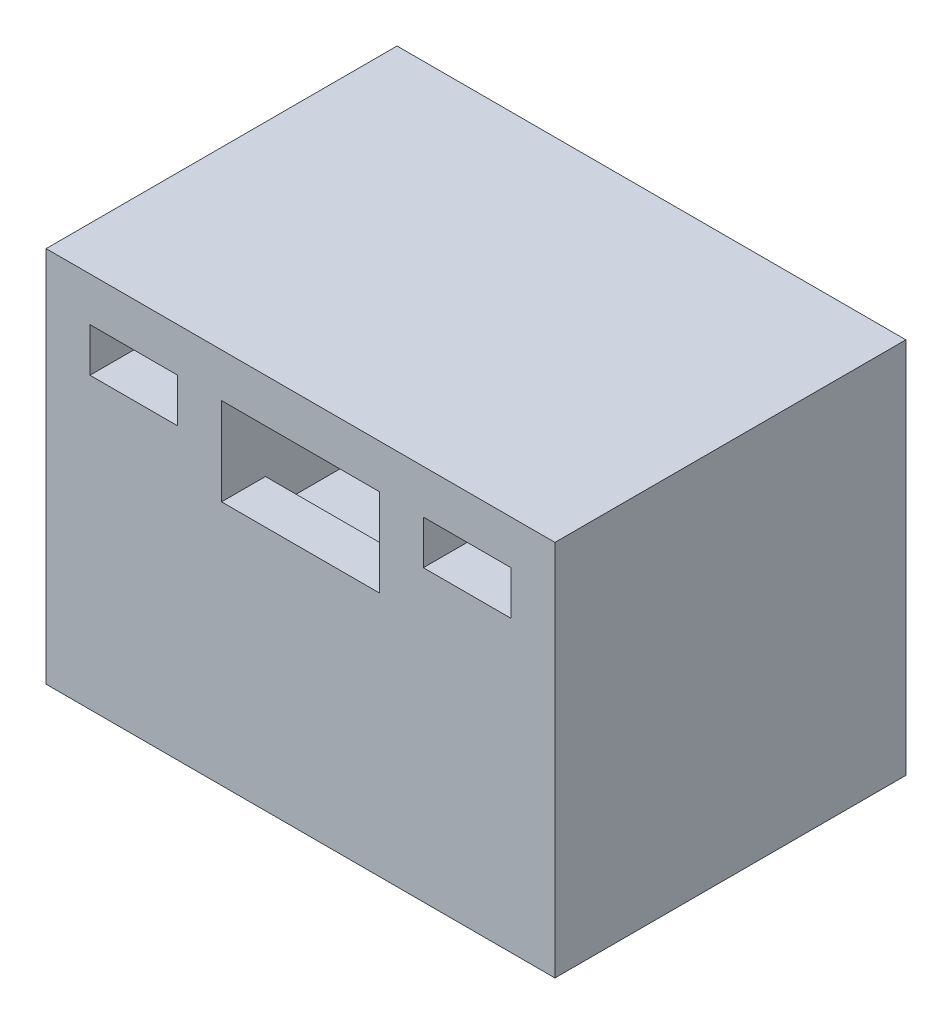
ISO-10303-21;
HEADER;
FILE_DESCRIPTION(('STEP AP214'),'2;1');
FILE_NAME('part.step','',(''),(''),'','','');
FILE_SCHEMA(('AUTOMOTIVE_DESIGN { 1 0 10303 214 1 1 1 1 }'));
ENDSEC;
DATA;
#1=APPLICATION_CONTEXT('core data for automotive mechanical design processes');
#2=APPLICATION_PROTOCOL_DEFINITION('international standard','automotive_design',2000,#1);
#3=PRODUCT_CONTEXT('',#1,'mechanical');
#4=PRODUCT('Part','Part','',(#3));
#5=PRODUCT_RELATED_PRODUCT_CATEGORY('part','',(#4));
#6=PRODUCT_DEFINITION_FORMATION('','',#4);
#7=PRODUCT_DEFINITION_CONTEXT('part definition',#1,'design');
#8=PRODUCT_DEFINITION('design','',#6,#7);
#9=PRODUCT_DEFINITION_SHAPE('','',#8);
#10=(LENGTH_UNIT() NAMED_UNIT(*) SI_UNIT(.MILLI.,.METRE.));
#11=(NAMED_UNIT(*) PLANE_ANGLE_UNIT() SI_UNIT($,.RADIAN.));
#12=(NAMED_UNIT(*) SI_UNIT($,.STERADIAN.) SOLID_ANGLE_UNIT());
#13=UNCERTAINTY_MEASURE_WITH_UNIT(LENGTH_MEASURE(1.E-05),#10,'distance_accuracy_value','');
#14=(GEOMETRIC_REPRESENTATION_CONTEXT(3) GLOBAL_UNCERTAINTY_ASSIGNED_CONTEXT((#13)) GLOBAL_UNIT_ASSIGNED_CONTEXT((#10,
#11,#12)) REPRESENTATION_CONTEXT('',''));
#15=CARTESIAN_POINT('',(0.,0.,0.));
#16=DIRECTION('',(0.,0.,1.));
#17=DIRECTION('',(1.,0.,0.));
#18=AXIS2_PLACEMENT_3D('',#15,#16,#17);
#19=CARTESIAN_POINT('',(0.900000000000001,0.300582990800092,4.));
#20=DIRECTION('',(0.,1.,0.));
#21=DIRECTION('',(-1.,0.,0.));
#22=AXIS2_PLACEMENT_3D('',#19,#20,#21);
#23=PLANE('',#22);
#24=DIRECTION('',(0.,0.,-1.));
#25=VECTOR('',#24,1.);
#26=CARTESIAN_POINT('',(-0.9,0.300582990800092,4.));
#27=LINE('',#26,#25);
#28=CARTESIAN_POINT('',(-0.9,0.300582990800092,3.5));
#29=VERTEX_POINT('',#28);
#30=CARTESIAN_POINT('',(-0.9,0.300582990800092,0.));
#31=VERTEX_POINT('',#30);
#32=EDGE_CURVE('E262',#29,#31,#27,.T.);
#33=ORIENTED_EDGE('',*,*,#32,.F.);
#34=DIRECTION('',(1.,0.,0.));
#35=VECTOR('',#34,1.);
#36=CARTESIAN_POINT('',(0.900000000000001,0.300582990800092,3.5));
#37=LINE('',#36,#35);
#38=CARTESIAN_POINT('',(0.900000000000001,0.300582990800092,3.5));
#39=VERTEX_POINT('',#38);
#40=EDGE_CURVE('E471',#29,#39,#37,.T.);
#41=ORIENTED_EDGE('',*,*,#40,.T.);
#42=DIRECTION('',(0.,0.,-1.));
#43=VECTOR('',#42,1.);
#44=CARTESIAN_POINT('',(0.900000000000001,0.300582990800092,4.));
#45=LINE('',#44,#43);
#46=CARTESIAN_POINT('',(0.900000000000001,0.300582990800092,0.));
#47=VERTEX_POINT('',#46);
#48=EDGE_CURVE('E260',#39,#47,#45,.T.);
#49=ORIENTED_EDGE('',*,*,#48,.T.);
#50=DIRECTION('',(1.,0.,0.));
#51=VECTOR('',#50,1.);
#52=CARTESIAN_POINT('',(0.900000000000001,0.300582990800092,0.));
#53=LINE('',#52,#51);
#54=EDGE_CURVE('E248',#31,#47,#53,.T.);
#55=ORIENTED_EDGE('',*,*,#54,.F.);
#56=EDGE_LOOP('',(#33,#41,#49,#55));
#57=FACE_BOUND('',#56,.T.);
#58=ADVANCED_FACE('F34',(#57),#23,.T.);
#59=CARTESIAN_POINT('',(-1.4,-0.199417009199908,4.));
#60=DIRECTION('',(-1.,0.,0.));
#61=DIRECTION('',(0.,0.,1.));
#62=AXIS2_PLACEMENT_3D('',#59,#60,#61);
#63=PLANE('',#62);
#64=DIRECTION('',(0.,0.,-1.));
#65=VECTOR('',#64,1.);
#66=CARTESIAN_POINT('',(-1.4,-0.199417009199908,4.));
#67=LINE('',#66,#65);
#68=CARTESIAN_POINT('',(-1.4,-0.199417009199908,3.5));
#69=VERTEX_POINT('',#68);
#70=CARTESIAN_POINT('',(-1.4,-0.199417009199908,0.));
#71=VERTEX_POINT('',#70);
#72=EDGE_CURVE('E517',#69,#71,#67,.T.);
#73=ORIENTED_EDGE('',*,*,#72,.F.);
#74=DIRECTION('',(0.,1.,0.));
#75=VECTOR('',#74,1.);
#76=CARTESIAN_POINT('',(-1.4,-0.199417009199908,3.5));
#77=LINE('',#76,#75);
#78=CARTESIAN_POINT('',(-1.4,0.649999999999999,3.5));
#79=VERTEX_POINT('',#78);
#80=EDGE_CURVE('E488',#69,#79,#77,.T.);
#81=ORIENTED_EDGE('',*,*,#80,.T.);
#82=DIRECTION('',(0.,0.,-1.));
#83=VECTOR('',#82,1.);
#84=CARTESIAN_POINT('',(-1.4,0.65,4.));
#85=LINE('',#84,#83);
#86=CARTESIAN_POINT('',(-1.4,0.65,0.));
#87=VERTEX_POINT('',#86);
#88=EDGE_CURVE('E231',#79,#87,#85,.T.);
#89=ORIENTED_EDGE('',*,*,#88,.T.);
#90=DIRECTION('',(0.,1.,0.));
#91=VECTOR('',#90,1.);
#92=CARTESIAN_POINT('',(-1.4,-0.199417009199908,0.));
#93=LINE('',#92,#91);
#94=EDGE_CURVE('E496',#71,#87,#93,.T.);
#95=ORIENTED_EDGE('',*,*,#94,.F.);
#96=EDGE_LOOP('',(#73,#81,#89,#95));
#97=FACE_BOUND('',#96,.T.);
#98=ADVANCED_FACE('F413',(#97),#63,.T.);
#99=CARTESIAN_POINT('',(-1.4,0.65,4.));
#100=DIRECTION('',(0.,-1.,0.));
#101=DIRECTION('',(1.,0.,0.));
#102=AXIS2_PLACEMENT_3D('',#99,#100,#101);
#103=PLANE('',#102);
#104=ORIENTED_EDGE('',*,*,#88,.F.);
#105=DIRECTION('',(-1.,0.,0.));
#106=VECTOR('',#105,1.);
#107=CARTESIAN_POINT('',(-2.4,0.649999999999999,3.5));
#108=LINE('',#107,#106);
#109=CARTESIAN_POINT('',(-2.4,0.649999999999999,3.5));
#110=VERTEX_POINT('',#109);
#111=EDGE_CURVE('E479',#79,#110,#108,.T.);
#112=ORIENTED_EDGE('',*,*,#111,.T.);
#113=DIRECTION('',(0.,0.,-1.));
#114=VECTOR('',#113,1.);
#115=CARTESIAN_POINT('',(-2.4,0.649999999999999,4.));
#116=LINE('',#115,#114);
#117=CARTESIAN_POINT('',(-2.4,0.649999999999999,0.));
#118=VERTEX_POINT('',#117);
#119=EDGE_CURVE('E222',#110,#118,#116,.T.);
#120=ORIENTED_EDGE('',*,*,#119,.T.);
#121=DIRECTION('',(-1.,0.,0.));
#122=VECTOR('',#121,1.);
#123=CARTESIAN_POINT('',(-1.4,0.65,0.));
#124=LINE('',#123,#122);
#125=EDGE_CURVE('E499',#87,#118,#124,.T.);
#126=ORIENTED_EDGE('',*,*,#125,.F.);
#127=EDGE_LOOP('',(#104,#112,#120,#126));
#128=FACE_BOUND('',#127,.T.);
#129=ADVANCED_FACE('F419',(#128),#103,.T.);
#130=CARTESIAN_POINT('',(-2.4,0.649999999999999,4.));
#131=DIRECTION('',(1.,0.,0.));
#132=DIRECTION('',(0.,1.,0.));
#133=AXIS2_PLACEMENT_3D('',#130,#131,#132);
#134=PLANE('',#133);
#135=ORIENTED_EDGE('',*,*,#119,.F.);
#136=DIRECTION('',(0.,-1.,0.));
#137=VECTOR('',#136,1.);
#138=CARTESIAN_POINT('',(-2.4,0.649999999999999,3.5));
#139=LINE('',#138,#137);
#140=CARTESIAN_POINT('',(-2.4,-1.65,3.5));
#141=VERTEX_POINT('',#140);
#142=EDGE_CURVE('E208',#110,#141,#139,.T.);
#143=ORIENTED_EDGE('',*,*,#142,.T.);
#144=DIRECTION('',(0.,0.,-1.));
#145=VECTOR('',#144,1.);
#146=CARTESIAN_POINT('',(-2.4,-1.65,4.));
#147=LINE('',#146,#145);
#148=CARTESIAN_POINT('',(-2.4,-1.65,0.));
#149=VERTEX_POINT('',#148);
#150=EDGE_CURVE('E220',#141,#149,#147,.T.);
#151=ORIENTED_EDGE('',*,*,#150,.T.);
#152=DIRECTION('',(0.,-1.,0.));
#153=VECTOR('',#152,1.);
#154=CARTESIAN_POINT('',(-2.4,0.649999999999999,0.));
#155=LINE('',#154,#153);
#156=EDGE_CURVE('E502',#118,#149,#155,.T.);
#157=ORIENTED_EDGE('',*,*,#156,.F.);
#158=EDGE_LOOP('',(#135,#143,#151,#157));
#159=FACE_BOUND('',#158,.T.);
#160=ADVANCED_FACE('F218',(#159),#134,.T.);
#161=CARTESIAN_POINT('',(-2.4,-1.65,4.));
#162=DIRECTION('',(0.,1.,0.));
#163=DIRECTION('',(-1.,0.,0.));
#164=AXIS2_PLACEMENT_3D('',#161,#162,#163);
#165=PLANE('',#164);
#166=ORIENTED_EDGE('',*,*,#150,.F.);
#167=DIRECTION('',(1.,0.,0.));
#168=VECTOR('',#167,1.);
#169=CARTESIAN_POINT('',(-2.4,-1.65,3.5));
#170=LINE('',#169,#168);
#171=CARTESIAN_POINT('',(2.4,-1.65,3.5));
#172=VERTEX_POINT('',#171);
#173=EDGE_CURVE('E205',#141,#172,#170,.T.);
#174=ORIENTED_EDGE('',*,*,#173,.T.);
#175=DIRECTION('',(0.,0.,-1.));
#176=VECTOR('',#175,1.);
#177=CARTESIAN_POINT('',(2.4,-1.65,4.));
#178=LINE('',#177,#176);
#179=CARTESIAN_POINT('',(2.4,-1.65,0.));
#180=VERTEX_POINT('',#179);
#181=EDGE_CURVE('E229',#172,#180,#178,.T.);
#182=ORIENTED_EDGE('',*,*,#181,.T.);
#183=DIRECTION('',(1.,0.,0.));
#184=VECTOR('',#183,1.);
#185=CARTESIAN_POINT('',(-2.4,-1.65,0.));
#186=LINE('',#185,#184);
#187=EDGE_CURVE('E227',#149,#180,#186,.T.);
#188=ORIENTED_EDGE('',*,*,#187,.F.);
#189=EDGE_LOOP('',(#166,#174,#182,#188));
#190=FACE_BOUND('',#189,.T.);
#191=ADVANCED_FACE('F225',(#190),#165,.T.);
#192=CARTESIAN_POINT('',(2.4,0.65,4.));
#193=DIRECTION('',(-1.,0.,0.));
#194=DIRECTION('',(0.,-1.,0.));
#195=AXIS2_PLACEMENT_3D('',#192,#193,#194);
#196=PLANE('',#195);
#197=ORIENTED_EDGE('',*,*,#181,.F.);
#198=DIRECTION('',(0.,1.,0.));
#199=VECTOR('',#198,1.);
#200=CARTESIAN_POINT('',(2.4,0.649999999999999,3.5));
#201=LINE('',#200,#199);
#202=CARTESIAN_POINT('',(2.4,0.649999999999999,3.5));
#203=VERTEX_POINT('',#202);
#204=EDGE_CURVE('E211',#172,#203,#201,.T.);
#205=ORIENTED_EDGE('',*,*,#204,.T.);
#206=DIRECTION('',(0.,0.,-1.));
#207=VECTOR('',#206,1.);
#208=CARTESIAN_POINT('',(2.4,0.65,4.));
#209=LINE('',#208,#207);
#210=CARTESIAN_POINT('',(2.4,0.65,0.));
#211=VERTEX_POINT('',#210);
#212=EDGE_CURVE('E233',#203,#211,#209,.T.);
#213=ORIENTED_EDGE('',*,*,#212,.T.);
#214=DIRECTION('',(0.,1.,0.));
#215=VECTOR('',#214,1.);
#216=CARTESIAN_POINT('',(2.4,0.65,0.));
#217=LINE('',#216,#215);
#218=EDGE_CURVE('E505',#180,#211,#217,.T.);
#219=ORIENTED_EDGE('',*,*,#218,.F.);
#220=EDGE_LOOP('',(#197,#205,#213,#219));
#221=FACE_BOUND('',#220,.T.);
#222=ADVANCED_FACE('F438',(#221),#196,.T.);
#223=CARTESIAN_POINT('',(1.4,0.65,4.));
#224=DIRECTION('',(0.,-1.,0.));
#225=DIRECTION('',(1.,0.,0.));
#226=AXIS2_PLACEMENT_3D('',#223,#224,#225);
#227=PLANE('',#226);
#228=ORIENTED_EDGE('',*,*,#212,.F.);
#229=CARTESIAN_POINT('',(1.4,0.649999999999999,3.5));
#230=VERTEX_POINT('',#229);
#231=EDGE_CURVE('E478',#203,#230,#108,.T.);
#232=ORIENTED_EDGE('',*,*,#231,.T.);
#233=DIRECTION('',(0.,0.,-1.));
#234=VECTOR('',#233,1.);
#235=CARTESIAN_POINT('',(1.4,0.65,4.));
#236=LINE('',#235,#234);
#237=CARTESIAN_POINT('',(1.4,0.65,0.));
#238=VERTEX_POINT('',#237);
#239=EDGE_CURVE('E521',#230,#238,#236,.T.);
#240=ORIENTED_EDGE('',*,*,#239,.T.);
#241=DIRECTION('',(-1.,0.,0.));
#242=VECTOR('',#241,1.);
#243=CARTESIAN_POINT('',(1.4,0.65,0.));
#244=LINE('',#243,#242);
#245=EDGE_CURVE('E508',#211,#238,#244,.T.);
#246=ORIENTED_EDGE('',*,*,#245,.F.);
#247=EDGE_LOOP('',(#228,#232,#240,#246));
#248=FACE_BOUND('',#247,.T.);
#249=ADVANCED_FACE('F441',(#248),#227,.T.);
#250=CARTESIAN_POINT('',(1.4,-0.199417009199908,4.));
#251=DIRECTION('',(1.,0.,0.));
#252=DIRECTION('',(0.,1.,0.));
#253=AXIS2_PLACEMENT_3D('',#250,#251,#252);
#254=PLANE('',#253);
#255=ORIENTED_EDGE('',*,*,#239,.F.);
#256=DIRECTION('',(0.,-1.,0.));
#257=VECTOR('',#256,1.);
#258=CARTESIAN_POINT('',(1.4,-0.199417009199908,3.5));
#259=LINE('',#258,#257);
#260=CARTESIAN_POINT('',(1.4,-0.199417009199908,3.5));
#261=VERTEX_POINT('',#260);
#262=EDGE_CURVE('E482',#230,#261,#259,.T.);
#263=ORIENTED_EDGE('',*,*,#262,.T.);
#264=DIRECTION('',(0.,0.,-1.));
#265=VECTOR('',#264,1.);
#266=CARTESIAN_POINT('',(1.4,-0.199417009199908,4.));
#267=LINE('',#266,#265);
#268=CARTESIAN_POINT('',(1.4,-0.199417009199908,0.));
#269=VERTEX_POINT('',#268);
#270=EDGE_CURVE('E519',#261,#269,#267,.T.);
#271=ORIENTED_EDGE('',*,*,#270,.T.);
#272=DIRECTION('',(0.,-1.,0.));
#273=VECTOR('',#272,1.);
#274=CARTESIAN_POINT('',(1.4,-0.199417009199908,0.));
#275=LINE('',#274,#273);
#276=EDGE_CURVE('E511',#238,#269,#275,.T.);
#277=ORIENTED_EDGE('',*,*,#276,.F.);
#278=EDGE_LOOP('',(#255,#263,#271,#277));
#279=FACE_BOUND('',#278,.T.);
#280=ADVANCED_FACE('F445',(#279),#254,.T.);
#281=CARTESIAN_POINT('',(1.4,-0.199417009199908,4.));
#282=DIRECTION('',(0.,-1.,0.));
#283=DIRECTION('',(1.,0.,0.));
#284=AXIS2_PLACEMENT_3D('',#281,#282,#283);
#285=PLANE('',#284);
#286=ORIENTED_EDGE('',*,*,#270,.F.);
#287=DIRECTION('',(-1.,0.,0.));
#288=VECTOR('',#287,1.);
#289=CARTESIAN_POINT('',(1.4,-0.199417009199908,3.5));
#290=LINE('',#289,#288);
#291=EDGE_CURVE('E11',#261,#69,#290,.T.);
#292=ORIENTED_EDGE('',*,*,#291,.T.);
#293=ORIENTED_EDGE('',*,*,#72,.T.);
#294=DIRECTION('',(-1.,0.,0.));
#295=VECTOR('',#294,1.);
#296=CARTESIAN_POINT('',(1.4,-0.199417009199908,0.));
#297=LINE('',#296,#295);
#298=EDGE_CURVE('E514',#269,#71,#297,.T.);
#299=ORIENTED_EDGE('',*,*,#298,.F.);
#300=EDGE_LOOP('',(#286,#292,#293,#299));
#301=FACE_BOUND('',#300,.T.);
#302=ADVANCED_FACE('F377',(#301),#285,.T.);
#303=CARTESIAN_POINT('',(0.,0.,4.));
#304=DIRECTION('',(0.,0.,1.));
#305=DIRECTION('',(1.,0.,0.));
#306=AXIS2_PLACEMENT_3D('',#303,#304,#305);
#307=PLANE('',#306);
#308=DIRECTION('',(0.,1.,0.));
#309=VECTOR('',#308,1.);
#310=CARTESIAN_POINT('',(0.900000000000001,1.65,4.));
#311=LINE('',#310,#309);
#312=CARTESIAN_POINT('',(0.900000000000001,0.649999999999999,4.));
#313=VERTEX_POINT('',#312);
#314=CARTESIAN_POINT('',(0.900000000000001,1.65,4.));
#315=VERTEX_POINT('',#314);
#316=EDGE_CURVE('E240',#313,#315,#311,.T.);
#317=ORIENTED_EDGE('',*,*,#316,.F.);
#318=DIRECTION('',(-1.,0.,0.));
#319=VECTOR('',#318,1.);
#320=CARTESIAN_POINT('',(-2.4,0.649999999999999,4.));
#321=LINE('',#320,#319);
#322=CARTESIAN_POINT('',(-0.9,0.65,4.));
#323=VERTEX_POINT('',#322);
#324=EDGE_CURVE('E223',#313,#323,#321,.T.);
#325=ORIENTED_EDGE('',*,*,#324,.T.);
#326=DIRECTION('',(0.,-1.,0.));
#327=VECTOR('',#326,1.);
#328=CARTESIAN_POINT('',(-0.9,1.65,4.));
#329=LINE('',#328,#327);
#330=CARTESIAN_POINT('',(-0.9,1.65,4.));
#331=VERTEX_POINT('',#330);
#332=EDGE_CURVE('E54',#331,#323,#329,.T.);
#333=ORIENTED_EDGE('',*,*,#332,.F.);
#334=DIRECTION('',(-1.,0.,0.));
#335=VECTOR('',#334,1.);
#336=CARTESIAN_POINT('',(0.900000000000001,1.65,4.));
#337=LINE('',#336,#335);
#338=EDGE_CURVE('E243',#315,#331,#337,.T.);
#339=ORIENTED_EDGE('',*,*,#338,.F.);
#340=EDGE_LOOP('',(#317,#325,#333,#339));
#341=FACE_BOUND('',#340,.T.);
#342=DIRECTION('',(0.,1.,0.));
#343=VECTOR('',#342,1.);
#344=CARTESIAN_POINT('',(2.9,2.15,4.));
#345=LINE('',#344,#343);
#346=CARTESIAN_POINT('',(2.9,-2.15,4.));
#347=VERTEX_POINT('',#346);
#348=CARTESIAN_POINT('',(2.9,2.15,4.));
#349=VERTEX_POINT('',#348);
#350=EDGE_CURVE('E327',#347,#349,#345,.T.);
#351=ORIENTED_EDGE('',*,*,#350,.T.);
#352=DIRECTION('',(-1.,0.,0.));
#353=VECTOR('',#352,1.);
#354=CARTESIAN_POINT('',(-2.9,2.15,4.));
#355=LINE('',#354,#353);
#356=CARTESIAN_POINT('',(-2.9,2.15,4.));
#357=VERTEX_POINT('',#356);
#358=EDGE_CURVE('E330',#349,#357,#355,.T.);
#359=ORIENTED_EDGE('',*,*,#358,.T.);
#360=DIRECTION('',(0.,-1.,0.));
#361=VECTOR('',#360,1.);
#362=CARTESIAN_POINT('',(-2.9,2.15,4.));
#363=LINE('',#362,#361);
#364=CARTESIAN_POINT('',(-2.9,-2.15,4.));
#365=VERTEX_POINT('',#364);
#366=EDGE_CURVE('E333',#357,#365,#363,.T.);
#367=ORIENTED_EDGE('',*,*,#366,.T.);
#368=DIRECTION('',(1.,0.,0.));
#369=VECTOR('',#368,1.);
#370=CARTESIAN_POINT('',(-2.9,-2.15,4.));
#371=LINE('',#370,#369);
#372=EDGE_CURVE('E335',#365,#347,#371,.T.);
#373=ORIENTED_EDGE('',*,*,#372,.T.);
#374=EDGE_LOOP('',(#351,#359,#367,#373));
#375=FACE_BOUND('',#374,.T.);
#376=DIRECTION('',(1.,0.,0.));
#377=VECTOR('',#376,1.);
#378=CARTESIAN_POINT('',(-2.4,1.15,4.));
#379=LINE('',#378,#377);
#380=CARTESIAN_POINT('',(-2.4,1.15,4.));
#381=VERTEX_POINT('',#380);
#382=CARTESIAN_POINT('',(-1.4,1.15,4.));
#383=VERTEX_POINT('',#382);
#384=EDGE_CURVE('E298',#381,#383,#379,.T.);
#385=ORIENTED_EDGE('',*,*,#384,.F.);
#386=DIRECTION('',(0.,-1.,0.));
#387=VECTOR('',#386,1.);
#388=CARTESIAN_POINT('',(-2.4,1.65,4.));
#389=LINE('',#388,#387);
#390=CARTESIAN_POINT('',(-2.4,1.65,4.));
#391=VERTEX_POINT('',#390);
#392=EDGE_CURVE('E296',#391,#381,#389,.T.);
#393=ORIENTED_EDGE('',*,*,#392,.F.);
#394=DIRECTION('',(-1.,0.,0.));
#395=VECTOR('',#394,1.);
#396=CARTESIAN_POINT('',(-2.4,1.65,4.));
#397=LINE('',#396,#395);
#398=CARTESIAN_POINT('',(-1.4,1.65,4.));
#399=VERTEX_POINT('',#398);
#400=EDGE_CURVE('E304',#399,#391,#397,.T.);
#401=ORIENTED_EDGE('',*,*,#400,.F.);
#402=DIRECTION('',(0.,1.,0.));
#403=VECTOR('',#402,1.);
#404=CARTESIAN_POINT('',(-1.4,1.65,4.));
#405=LINE('',#404,#403);
#406=EDGE_CURVE('E301',#383,#399,#405,.T.);
#407=ORIENTED_EDGE('',*,*,#406,.F.);
#408=EDGE_LOOP('',(#385,#393,#401,#407));
#409=FACE_BOUND('',#408,.T.);
#410=DIRECTION('',(0.,-1.,0.));
#411=VECTOR('',#410,1.);
#412=CARTESIAN_POINT('',(1.4,1.65,4.));
#413=LINE('',#412,#411);
#414=CARTESIAN_POINT('',(1.4,1.65,4.));
#415=VERTEX_POINT('',#414);
#416=CARTESIAN_POINT('',(1.4,1.15,4.));
#417=VERTEX_POINT('',#416);
#418=EDGE_CURVE('E267',#415,#417,#413,.T.);
#419=ORIENTED_EDGE('',*,*,#418,.F.);
#420=DIRECTION('',(-1.,0.,0.));
#421=VECTOR('',#420,1.);
#422=CARTESIAN_POINT('',(2.4,1.65,4.));
#423=LINE('',#422,#421);
#424=CARTESIAN_POINT('',(2.4,1.65,4.));
#425=VERTEX_POINT('',#424);
#426=EDGE_CURVE('E265',#425,#415,#423,.T.);
#427=ORIENTED_EDGE('',*,*,#426,.F.);
#428=DIRECTION('',(0.,1.,0.));
#429=VECTOR('',#428,1.);
#430=CARTESIAN_POINT('',(2.4,1.65,4.));
#431=LINE('',#430,#429);
#432=CARTESIAN_POINT('',(2.4,1.15,4.));
#433=VERTEX_POINT('',#432);
#434=EDGE_CURVE('E273',#433,#425,#431,.T.);
#435=ORIENTED_EDGE('',*,*,#434,.F.);
#436=DIRECTION('',(1.,0.,0.));
#437=VECTOR('',#436,1.);
#438=CARTESIAN_POINT('',(2.4,1.15,4.));
#439=LINE('',#438,#437);
#440=EDGE_CURVE('E270',#417,#433,#439,.T.);
#441=ORIENTED_EDGE('',*,*,#440,.F.);
#442=EDGE_LOOP('',(#419,#427,#435,#441));
#443=FACE_BOUND('',#442,.T.);
#444=ADVANCED_FACE('F374',(#341,#375,#409,#443),#307,.T.);
#445=CARTESIAN_POINT('',(0.,0.,0.));
#446=DIRECTION('',(0.,0.,1.));
#447=DIRECTION('',(1.,0.,0.));
#448=AXIS2_PLACEMENT_3D('',#445,#446,#447);
#449=PLANE('',#448);
#450=DIRECTION('',(0.,-1.,0.));
#451=VECTOR('',#450,1.);
#452=CARTESIAN_POINT('',(-0.9,1.65,0.));
#453=LINE('',#452,#451);
#454=CARTESIAN_POINT('',(-0.9,1.65,0.));
#455=VERTEX_POINT('',#454);
#456=EDGE_CURVE('E238',#455,#31,#453,.T.);
#457=ORIENTED_EDGE('',*,*,#456,.T.);
#458=ORIENTED_EDGE('',*,*,#54,.T.);
#459=DIRECTION('',(0.,1.,0.));
#460=VECTOR('',#459,1.);
#461=CARTESIAN_POINT('',(0.900000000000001,1.65,0.));
#462=LINE('',#461,#460);
#463=CARTESIAN_POINT('',(0.900000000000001,1.65,0.));
#464=VERTEX_POINT('',#463);
#465=EDGE_CURVE('E251',#47,#464,#462,.T.);
#466=ORIENTED_EDGE('',*,*,#465,.T.);
#467=DIRECTION('',(-1.,0.,0.));
#468=VECTOR('',#467,1.);
#469=CARTESIAN_POINT('',(0.900000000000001,1.65,0.));
#470=LINE('',#469,#468);
#471=EDGE_CURVE('E241',#464,#455,#470,.T.);
#472=ORIENTED_EDGE('',*,*,#471,.T.);
#473=EDGE_LOOP('',(#457,#458,#466,#472));
#474=FACE_BOUND('',#473,.T.);
#475=DIRECTION('',(0.,-1.,0.));
#476=VECTOR('',#475,1.);
#477=CARTESIAN_POINT('',(-2.4,1.65,0.));
#478=LINE('',#477,#476);
#479=CARTESIAN_POINT('',(-2.4,1.65,0.));
#480=VERTEX_POINT('',#479);
#481=CARTESIAN_POINT('',(-2.4,1.15,0.));
#482=VERTEX_POINT('',#481);
#483=EDGE_CURVE('E295',#480,#482,#478,.T.);
#484=ORIENTED_EDGE('',*,*,#483,.T.);
#485=DIRECTION('',(1.,0.,0.));
#486=VECTOR('',#485,1.);
#487=CARTESIAN_POINT('',(-2.4,1.15,0.));
#488=LINE('',#487,#486);
#489=CARTESIAN_POINT('',(-1.4,1.15,0.));
#490=VERTEX_POINT('',#489);
#491=EDGE_CURVE('E309',#482,#490,#488,.T.);
#492=ORIENTED_EDGE('',*,*,#491,.T.);
#493=DIRECTION('',(0.,1.,0.));
#494=VECTOR('',#493,1.);
#495=CARTESIAN_POINT('',(-1.4,1.65,0.));
#496=LINE('',#495,#494);
#497=CARTESIAN_POINT('',(-1.4,1.65,0.));
#498=VERTEX_POINT('',#497);
#499=EDGE_CURVE('E312',#490,#498,#496,.T.);
#500=ORIENTED_EDGE('',*,*,#499,.T.);
#501=DIRECTION('',(-1.,0.,0.));
#502=VECTOR('',#501,1.);
#503=CARTESIAN_POINT('',(-2.4,1.65,0.));
#504=LINE('',#503,#502);
#505=EDGE_CURVE('E299',#498,#480,#504,.T.);
#506=ORIENTED_EDGE('',*,*,#505,.T.);
#507=EDGE_LOOP('',(#484,#492,#500,#506));
#508=FACE_BOUND('',#507,.T.);
#509=DIRECTION('',(0.,1.,0.));
#510=VECTOR('',#509,1.);
#511=CARTESIAN_POINT('',(2.9,2.15,0.));
#512=LINE('',#511,#510);
#513=CARTESIAN_POINT('',(2.9,-2.15,0.));
#514=VERTEX_POINT('',#513);
#515=CARTESIAN_POINT('',(2.9,2.15,0.));
#516=VERTEX_POINT('',#515);
#517=EDGE_CURVE('E326',#514,#516,#512,.T.);
#518=ORIENTED_EDGE('',*,*,#517,.F.);
#519=DIRECTION('',(1.,0.,0.));
#520=VECTOR('',#519,1.);
#521=CARTESIAN_POINT('',(-2.9,-2.15,0.));
#522=LINE('',#521,#520);
#523=CARTESIAN_POINT('',(-2.9,-2.15,0.));
#524=VERTEX_POINT('',#523);
#525=EDGE_CURVE('E331',#524,#514,#522,.T.);
#526=ORIENTED_EDGE('',*,*,#525,.F.);
#527=DIRECTION('',(0.,-1.,0.));
#528=VECTOR('',#527,1.);
#529=CARTESIAN_POINT('',(-2.9,2.15,0.));
#530=LINE('',#529,#528);
#531=CARTESIAN_POINT('',(-2.9,2.15,0.));
#532=VERTEX_POINT('',#531);
#533=EDGE_CURVE('E342',#532,#524,#530,.T.);
#534=ORIENTED_EDGE('',*,*,#533,.F.);
#535=DIRECTION('',(-1.,0.,0.));
#536=VECTOR('',#535,1.);
#537=CARTESIAN_POINT('',(-2.9,2.15,0.));
#538=LINE('',#537,#536);
#539=EDGE_CURVE('E340',#516,#532,#538,.T.);
#540=ORIENTED_EDGE('',*,*,#539,.F.);
#541=EDGE_LOOP('',(#518,#526,#534,#540));
#542=FACE_BOUND('',#541,.T.);
#543=DIRECTION('',(-1.,0.,0.));
#544=VECTOR('',#543,1.);
#545=CARTESIAN_POINT('',(2.4,1.65,0.));
#546=LINE('',#545,#544);
#547=CARTESIAN_POINT('',(2.4,1.65,0.));
#548=VERTEX_POINT('',#547);
#549=CARTESIAN_POINT('',(1.4,1.65,0.));
#550=VERTEX_POINT('',#549);
#551=EDGE_CURVE('E264',#548,#550,#546,.T.);
#552=ORIENTED_EDGE('',*,*,#551,.T.);
#553=DIRECTION('',(0.,-1.,0.));
#554=VECTOR('',#553,1.);
#555=CARTESIAN_POINT('',(1.4,1.65,0.));
#556=LINE('',#555,#554);
#557=CARTESIAN_POINT('',(1.4,1.15,0.));
#558=VERTEX_POINT('',#557);
#559=EDGE_CURVE('E278',#550,#558,#556,.T.);
#560=ORIENTED_EDGE('',*,*,#559,.T.);
#561=DIRECTION('',(1.,0.,0.));
#562=VECTOR('',#561,1.);
#563=CARTESIAN_POINT('',(2.4,1.15,0.));
#564=LINE('',#563,#562);
#565=CARTESIAN_POINT('',(2.4,1.15,0.));
#566=VERTEX_POINT('',#565);
#567=EDGE_CURVE('E281',#558,#566,#564,.T.);
#568=ORIENTED_EDGE('',*,*,#567,.T.);
#569=DIRECTION('',(0.,1.,0.));
#570=VECTOR('',#569,1.);
#571=CARTESIAN_POINT('',(2.4,1.65,0.));
#572=LINE('',#571,#570);
#573=EDGE_CURVE('E268',#566,#548,#572,.T.);
#574=ORIENTED_EDGE('',*,*,#573,.T.);
#575=EDGE_LOOP('',(#552,#560,#568,#574));
#576=FACE_BOUND('',#575,.T.);
#577=ORIENTED_EDGE('',*,*,#94,.T.);
#578=ORIENTED_EDGE('',*,*,#125,.T.);
#579=ORIENTED_EDGE('',*,*,#156,.T.);
#580=ORIENTED_EDGE('',*,*,#187,.T.);
#581=ORIENTED_EDGE('',*,*,#218,.T.);
#582=ORIENTED_EDGE('',*,*,#245,.T.);
#583=ORIENTED_EDGE('',*,*,#276,.T.);
#584=ORIENTED_EDGE('',*,*,#298,.T.);
#585=EDGE_LOOP('',(#577,#578,#579,#580,#581,#582,#583,#584));
#586=FACE_BOUND('',#585,.T.);
#587=ADVANCED_FACE('F363',(#474,#508,#542,#576,#586),#449,.F.);
#588=CARTESIAN_POINT('',(2.9,2.15,4.));
#589=DIRECTION('',(-1.,0.,0.));
#590=DIRECTION('',(0.,-1.,0.));
#591=AXIS2_PLACEMENT_3D('',#588,#589,#590);
#592=PLANE('',#591);
#593=ORIENTED_EDGE('',*,*,#517,.T.);
#594=DIRECTION('',(0.,0.,-1.));
#595=VECTOR('',#594,1.);
#596=CARTESIAN_POINT('',(2.9,2.15,4.));
#597=LINE('',#596,#595);
#598=EDGE_CURVE('E42',#349,#516,#597,.T.);
#599=ORIENTED_EDGE('',*,*,#598,.F.);
#600=ORIENTED_EDGE('',*,*,#350,.F.);
#601=DIRECTION('',(0.,0.,-1.));
#602=VECTOR('',#601,1.);
#603=CARTESIAN_POINT('',(2.9,-2.15,4.));
#604=LINE('',#603,#602);
#605=EDGE_CURVE('E337',#347,#514,#604,.T.);
#606=ORIENTED_EDGE('',*,*,#605,.T.);
#607=EDGE_LOOP('',(#593,#599,#600,#606));
#608=FACE_BOUND('',#607,.T.);
#609=ADVANCED_FACE('F36',(#608),#592,.F.);
#610=CARTESIAN_POINT('',(-2.9,2.15,4.));
#611=DIRECTION('',(0.,-1.,0.));
#612=DIRECTION('',(0.,0.,-1.));
#613=AXIS2_PLACEMENT_3D('',#610,#611,#612);
#614=PLANE('',#613);
#615=ORIENTED_EDGE('',*,*,#539,.T.);
#616=DIRECTION('',(0.,0.,-1.));
#617=VECTOR('',#616,1.);
#618=CARTESIAN_POINT('',(-2.9,2.15,4.));
#619=LINE('',#618,#617);
#620=EDGE_CURVE('E350',#357,#532,#619,.T.);
#621=ORIENTED_EDGE('',*,*,#620,.F.);
#622=ORIENTED_EDGE('',*,*,#358,.F.);
#623=ORIENTED_EDGE('',*,*,#598,.T.);
#624=EDGE_LOOP('',(#615,#621,#622,#623));
#625=FACE_BOUND('',#624,.T.);
#626=ADVANCED_FACE('F355',(#625),#614,.F.);
#627=CARTESIAN_POINT('',(-2.9,2.15,4.));
#628=DIRECTION('',(1.,0.,0.));
#629=DIRECTION('',(0.,1.,0.));
#630=AXIS2_PLACEMENT_3D('',#627,#628,#629);
#631=PLANE('',#630);
#632=ORIENTED_EDGE('',*,*,#533,.T.);
#633=DIRECTION('',(0.,0.,-1.));
#634=VECTOR('',#633,1.);
#635=CARTESIAN_POINT('',(-2.9,-2.15,4.));
#636=LINE('',#635,#634);
#637=EDGE_CURVE('E347',#365,#524,#636,.T.);
#638=ORIENTED_EDGE('',*,*,#637,.F.);
#639=ORIENTED_EDGE('',*,*,#366,.F.);
#640=ORIENTED_EDGE('',*,*,#620,.T.);
#641=EDGE_LOOP('',(#632,#638,#639,#640));
#642=FACE_BOUND('',#641,.T.);
#643=ADVANCED_FACE('F368',(#642),#631,.F.);
#644=CARTESIAN_POINT('',(-2.9,-2.15,4.));
#645=DIRECTION('',(0.,1.,0.));
#646=DIRECTION('',(0.,0.,1.));
#647=AXIS2_PLACEMENT_3D('',#644,#645,#646);
#648=PLANE('',#647);
#649=ORIENTED_EDGE('',*,*,#525,.T.);
#650=ORIENTED_EDGE('',*,*,#605,.F.);
#651=ORIENTED_EDGE('',*,*,#372,.F.);
#652=ORIENTED_EDGE('',*,*,#637,.T.);
#653=EDGE_LOOP('',(#649,#650,#651,#652));
#654=FACE_BOUND('',#653,.T.);
#655=ADVANCED_FACE('F372',(#654),#648,.F.);
#656=CARTESIAN_POINT('',(-2.4,1.65,4.));
#657=DIRECTION('',(1.,0.,0.));
#658=DIRECTION('',(0.,1.,0.));
#659=AXIS2_PLACEMENT_3D('',#656,#657,#658);
#660=PLANE('',#659);
#661=ORIENTED_EDGE('',*,*,#483,.F.);
#662=DIRECTION('',(0.,0.,-1.));
#663=VECTOR('',#662,1.);
#664=CARTESIAN_POINT('',(-2.4,1.65,4.));
#665=LINE('',#664,#663);
#666=EDGE_CURVE('E306',#391,#480,#665,.T.);
#667=ORIENTED_EDGE('',*,*,#666,.F.);
#668=ORIENTED_EDGE('',*,*,#392,.T.);
#669=DIRECTION('',(0.,0.,-1.));
#670=VECTOR('',#669,1.);
#671=CARTESIAN_POINT('',(-2.4,1.15,4.));
#672=LINE('',#671,#670);
#673=EDGE_CURVE('E323',#381,#482,#672,.T.);
#674=ORIENTED_EDGE('',*,*,#673,.T.);
#675=EDGE_LOOP('',(#661,#667,#668,#674));
#676=FACE_BOUND('',#675,.T.);
#677=ADVANCED_FACE('F544',(#676),#660,.T.);
#678=CARTESIAN_POINT('',(-2.4,1.15,4.));
#679=DIRECTION('',(0.,1.,0.));
#680=DIRECTION('',(0.,0.,1.));
#681=AXIS2_PLACEMENT_3D('',#678,#679,#680);
#682=PLANE('',#681);
#683=ORIENTED_EDGE('',*,*,#491,.F.);
#684=ORIENTED_EDGE('',*,*,#673,.F.);
#685=ORIENTED_EDGE('',*,*,#384,.T.);
#686=DIRECTION('',(0.,0.,-1.));
#687=VECTOR('',#686,1.);
#688=CARTESIAN_POINT('',(-1.4,1.15,4.));
#689=LINE('',#688,#687);
#690=EDGE_CURVE('E321',#383,#490,#689,.T.);
#691=ORIENTED_EDGE('',*,*,#690,.T.);
#692=EDGE_LOOP('',(#683,#684,#685,#691));
#693=FACE_BOUND('',#692,.T.);
#694=ADVANCED_FACE('F565',(#693),#682,.T.);
#695=CARTESIAN_POINT('',(-1.4,1.65,4.));
#696=DIRECTION('',(-1.,0.,0.));
#697=DIRECTION('',(0.,-1.,0.));
#698=AXIS2_PLACEMENT_3D('',#695,#696,#697);
#699=PLANE('',#698);
#700=ORIENTED_EDGE('',*,*,#499,.F.);
#701=ORIENTED_EDGE('',*,*,#690,.F.);
#702=ORIENTED_EDGE('',*,*,#406,.T.);
#703=DIRECTION('',(0.,0.,-1.));
#704=VECTOR('',#703,1.);
#705=CARTESIAN_POINT('',(-1.4,1.65,4.));
#706=LINE('',#705,#704);
#707=EDGE_CURVE('E319',#399,#498,#706,.T.);
#708=ORIENTED_EDGE('',*,*,#707,.T.);
#709=EDGE_LOOP('',(#700,#701,#702,#708));
#710=FACE_BOUND('',#709,.T.);
#711=ADVANCED_FACE('F572',(#710),#699,.T.);
#712=CARTESIAN_POINT('',(-2.4,1.65,4.));
#713=DIRECTION('',(0.,-1.,0.));
#714=DIRECTION('',(1.,0.,0.));
#715=AXIS2_PLACEMENT_3D('',#712,#713,#714);
#716=PLANE('',#715);
#717=ORIENTED_EDGE('',*,*,#505,.F.);
#718=ORIENTED_EDGE('',*,*,#707,.F.);
#719=ORIENTED_EDGE('',*,*,#400,.T.);
#720=ORIENTED_EDGE('',*,*,#666,.T.);
#721=EDGE_LOOP('',(#717,#718,#719,#720));
#722=FACE_BOUND('',#721,.T.);
#723=ADVANCED_FACE('F580',(#722),#716,.T.);
#724=CARTESIAN_POINT('',(2.4,1.65,4.));
#725=DIRECTION('',(0.,-1.,0.));
#726=DIRECTION('',(1.,0.,0.));
#727=AXIS2_PLACEMENT_3D('',#724,#725,#726);
#728=PLANE('',#727);
#729=ORIENTED_EDGE('',*,*,#551,.F.);
#730=DIRECTION('',(0.,0.,-1.));
#731=VECTOR('',#730,1.);
#732=CARTESIAN_POINT('',(2.4,1.65,4.));
#733=LINE('',#732,#731);
#734=EDGE_CURVE('E275',#425,#548,#733,.T.);
#735=ORIENTED_EDGE('',*,*,#734,.F.);
#736=ORIENTED_EDGE('',*,*,#426,.T.);
#737=DIRECTION('',(0.,0.,-1.));
#738=VECTOR('',#737,1.);
#739=CARTESIAN_POINT('',(1.4,1.65,4.));
#740=LINE('',#739,#738);
#741=EDGE_CURVE('E292',#415,#550,#740,.T.);
#742=ORIENTED_EDGE('',*,*,#741,.T.);
#743=EDGE_LOOP('',(#729,#735,#736,#742));
#744=FACE_BOUND('',#743,.T.);
#745=ADVANCED_FACE('F398',(#744),#728,.T.);
#746=CARTESIAN_POINT('',(1.4,1.65,4.));
#747=DIRECTION('',(1.,0.,0.));
#748=DIRECTION('',(0.,1.,0.));
#749=AXIS2_PLACEMENT_3D('',#746,#747,#748);
#750=PLANE('',#749);
#751=ORIENTED_EDGE('',*,*,#559,.F.);
#752=ORIENTED_EDGE('',*,*,#741,.F.);
#753=ORIENTED_EDGE('',*,*,#418,.T.);
#754=DIRECTION('',(0.,0.,-1.));
#755=VECTOR('',#754,1.);
#756=CARTESIAN_POINT('',(1.4,1.15,4.));
#757=LINE('',#756,#755);
#758=EDGE_CURVE('E290',#417,#558,#757,.T.);
#759=ORIENTED_EDGE('',*,*,#758,.T.);
#760=EDGE_LOOP('',(#751,#752,#753,#759));
#761=FACE_BOUND('',#760,.T.);
#762=ADVANCED_FACE('F391',(#761),#750,.T.);
#763=CARTESIAN_POINT('',(2.4,1.15,4.));
#764=DIRECTION('',(0.,1.,0.));
#765=DIRECTION('',(-1.,0.,0.));
#766=AXIS2_PLACEMENT_3D('',#763,#764,#765);
#767=PLANE('',#766);
#768=ORIENTED_EDGE('',*,*,#567,.F.);
#769=ORIENTED_EDGE('',*,*,#758,.F.);
#770=ORIENTED_EDGE('',*,*,#440,.T.);
#771=DIRECTION('',(0.,0.,-1.));
#772=VECTOR('',#771,1.);
#773=CARTESIAN_POINT('',(2.4,1.15,4.));
#774=LINE('',#773,#772);
#775=EDGE_CURVE('E288',#433,#566,#774,.T.);
#776=ORIENTED_EDGE('',*,*,#775,.T.);
#777=EDGE_LOOP('',(#768,#769,#770,#776));
#778=FACE_BOUND('',#777,.T.);
#779=ADVANCED_FACE('F394',(#778),#767,.T.);
#780=CARTESIAN_POINT('',(2.4,1.65,4.));
#781=DIRECTION('',(-1.,0.,0.));
#782=DIRECTION('',(0.,0.,1.));
#783=AXIS2_PLACEMENT_3D('',#780,#781,#782);
#784=PLANE('',#783);
#785=ORIENTED_EDGE('',*,*,#573,.F.);
#786=ORIENTED_EDGE('',*,*,#775,.F.);
#787=ORIENTED_EDGE('',*,*,#434,.T.);
#788=ORIENTED_EDGE('',*,*,#734,.T.);
#789=EDGE_LOOP('',(#785,#786,#787,#788));
#790=FACE_BOUND('',#789,.T.);
#791=ADVANCED_FACE('F401',(#790),#784,.T.);
#792=CARTESIAN_POINT('',(-0.9,1.65,4.));
#793=DIRECTION('',(1.,0.,0.));
#794=DIRECTION('',(0.,1.,0.));
#795=AXIS2_PLACEMENT_3D('',#792,#793,#794);
#796=PLANE('',#795);
#797=DIRECTION('',(0.,0.,1.));
#798=VECTOR('',#797,1.);
#799=CARTESIAN_POINT('',(-0.9,0.65,4.));
#800=LINE('',#799,#798);
#801=CARTESIAN_POINT('',(-0.9,0.65,3.5));
#802=VERTEX_POINT('',#801);
#803=EDGE_CURVE('E49',#802,#323,#800,.T.);
#804=ORIENTED_EDGE('',*,*,#803,.F.);
#805=DIRECTION('',(0.,-1.,0.));
#806=VECTOR('',#805,1.);
#807=CARTESIAN_POINT('',(-0.9,1.65,3.5));
#808=LINE('',#807,#806);
#809=EDGE_CURVE('E467',#802,#29,#808,.T.);
#810=ORIENTED_EDGE('',*,*,#809,.T.);
#811=ORIENTED_EDGE('',*,*,#32,.T.);
#812=ORIENTED_EDGE('',*,*,#456,.F.);
#813=DIRECTION('',(0.,0.,-1.));
#814=VECTOR('',#813,1.);
#815=CARTESIAN_POINT('',(-0.9,1.65,4.));
#816=LINE('',#815,#814);
#817=EDGE_CURVE('E245',#331,#455,#816,.T.);
#818=ORIENTED_EDGE('',*,*,#817,.F.);
#819=ORIENTED_EDGE('',*,*,#332,.T.);
#820=EDGE_LOOP('',(#804,#810,#811,#812,#818,#819));
#821=FACE_BOUND('',#820,.T.);
#822=ADVANCED_FACE('F403',(#821),#796,.T.);
#823=CARTESIAN_POINT('',(0.900000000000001,1.65,4.));
#824=DIRECTION('',(-1.,0.,0.));
#825=DIRECTION('',(0.,-1.,0.));
#826=AXIS2_PLACEMENT_3D('',#823,#824,#825);
#827=PLANE('',#826);
#828=DIRECTION('',(0.,0.,-1.));
#829=VECTOR('',#828,1.);
#830=CARTESIAN_POINT('',(0.900000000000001,0.649999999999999,4.));
#831=LINE('',#830,#829);
#832=CARTESIAN_POINT('',(0.900000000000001,0.65,3.5));
#833=VERTEX_POINT('',#832);
#834=EDGE_CURVE('E472',#313,#833,#831,.T.);
#835=ORIENTED_EDGE('',*,*,#834,.F.);
#836=ORIENTED_EDGE('',*,*,#316,.T.);
#837=DIRECTION('',(0.,0.,-1.));
#838=VECTOR('',#837,1.);
#839=CARTESIAN_POINT('',(0.900000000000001,1.65,4.));
#840=LINE('',#839,#838);
#841=EDGE_CURVE('E258',#315,#464,#840,.T.);
#842=ORIENTED_EDGE('',*,*,#841,.T.);
#843=ORIENTED_EDGE('',*,*,#465,.F.);
#844=ORIENTED_EDGE('',*,*,#48,.F.);
#845=DIRECTION('',(0.,1.,0.));
#846=VECTOR('',#845,1.);
#847=CARTESIAN_POINT('',(0.900000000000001,1.65,3.5));
#848=LINE('',#847,#846);
#849=EDGE_CURVE('E491',#39,#833,#848,.T.);
#850=ORIENTED_EDGE('',*,*,#849,.T.);
#851=EDGE_LOOP('',(#835,#836,#842,#843,#844,#850));
#852=FACE_BOUND('',#851,.T.);
#853=ADVANCED_FACE('F409',(#852),#827,.T.);
#854=CARTESIAN_POINT('',(0.900000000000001,1.65,4.));
#855=DIRECTION('',(0.,-1.,0.));
#856=DIRECTION('',(1.,0.,0.));
#857=AXIS2_PLACEMENT_3D('',#854,#855,#856);
#858=PLANE('',#857);
#859=ORIENTED_EDGE('',*,*,#471,.F.);
#860=ORIENTED_EDGE('',*,*,#841,.F.);
#861=ORIENTED_EDGE('',*,*,#338,.T.);
#862=ORIENTED_EDGE('',*,*,#817,.T.);
#863=EDGE_LOOP('',(#859,#860,#861,#862));
#864=FACE_BOUND('',#863,.T.);
#865=ADVANCED_FACE('F426',(#864),#858,.T.);
#866=CARTESIAN_POINT('',(0.,0.,3.5));
#867=DIRECTION('',(0.,0.,1.));
#868=DIRECTION('',(1.,0.,0.));
#869=AXIS2_PLACEMENT_3D('',#866,#867,#868);
#870=PLANE('',#869);
#871=ORIENTED_EDGE('',*,*,#80,.F.);
#872=ORIENTED_EDGE('',*,*,#291,.F.);
#873=ORIENTED_EDGE('',*,*,#262,.F.);
#874=ORIENTED_EDGE('',*,*,#231,.F.);
#875=ORIENTED_EDGE('',*,*,#204,.F.);
#876=ORIENTED_EDGE('',*,*,#173,.F.);
#877=ORIENTED_EDGE('',*,*,#142,.F.);
#878=ORIENTED_EDGE('',*,*,#111,.F.);
#879=EDGE_LOOP('',(#871,#872,#873,#874,#875,#876,#877,#878));
#880=FACE_BOUND('',#879,.T.);
#881=ADVANCED_FACE('F207',(#880),#870,.F.);
#882=CARTESIAN_POINT('',(-2.4,0.649999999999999,3.5));
#883=DIRECTION('',(0.,1.,0.));
#884=DIRECTION('',(0.,0.,1.));
#885=AXIS2_PLACEMENT_3D('',#882,#883,#884);
#886=PLANE('',#885);
#887=EDGE_CURVE('E470',#833,#802,#108,.T.);
#888=ORIENTED_EDGE('',*,*,#887,.T.);
#889=ORIENTED_EDGE('',*,*,#803,.T.);
#890=ORIENTED_EDGE('',*,*,#324,.F.);
#891=ORIENTED_EDGE('',*,*,#834,.T.);
#892=EDGE_LOOP('',(#888,#889,#890,#891));
#893=FACE_BOUND('',#892,.T.);
#894=ADVANCED_FACE('F453',(#893),#886,.T.);
#895=ORIENTED_EDGE('',*,*,#809,.F.);
#896=ORIENTED_EDGE('',*,*,#887,.F.);
#897=ORIENTED_EDGE('',*,*,#849,.F.);
#898=ORIENTED_EDGE('',*,*,#40,.F.);
#899=EDGE_LOOP('',(#895,#896,#897,#898));
#900=FACE_BOUND('',#899,.T.);
#901=ADVANCED_FACE('F456',(#900),#870,.F.);
#902=CLOSED_SHELL('',(#58,#98,#129,#160,#191,#222,#249,#280,#302,#444,#587,#609,#626,#643,#655,
#677,#694,#711,#723,#745,#762,#779,#791,#822,#853,#865,#881,#894,#901));
#903=MANIFOLD_SOLID_BREP('B2',#902);
#904=ADVANCED_BREP_SHAPE_REPRESENTATION('',(#18,#903),#14);
#905=SHAPE_DEFINITION_REPRESENTATION(#9,#904);
ENDSEC;
END-ISO-10303-21;
